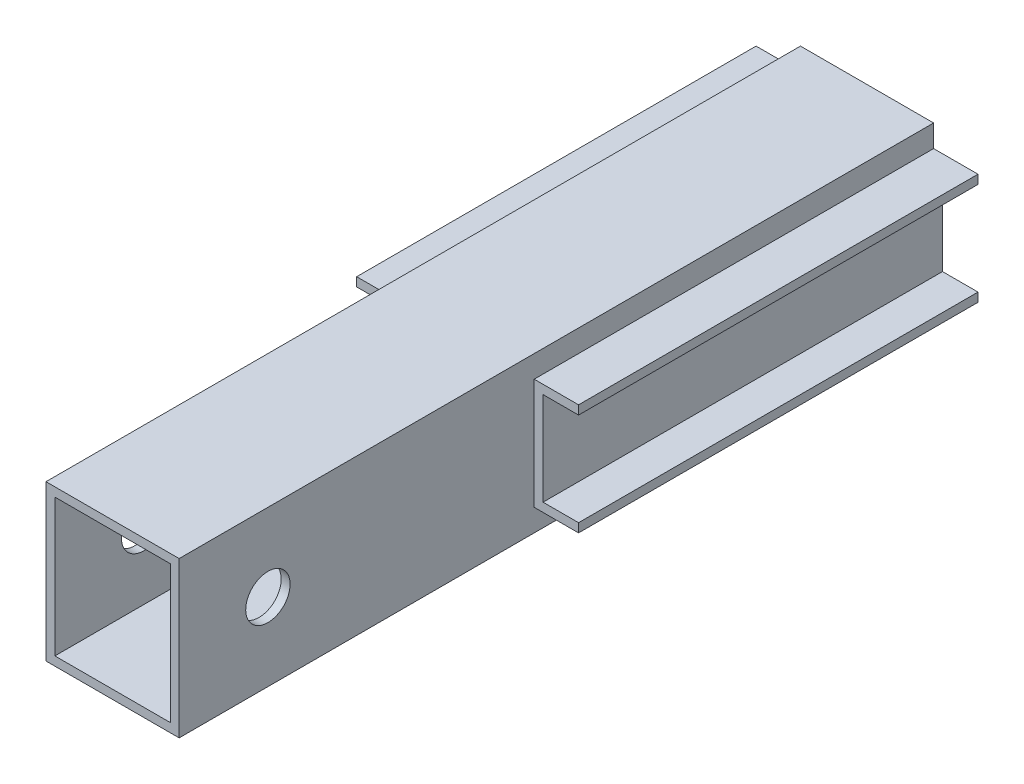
from build123d import *

# Parameters (mm, degrees)
ESQUISSE1_W             = 30
ESQUISSE1_H             = 35
ESQUISSE1_W_2           = 26
ESQUISSE1_H_2           = 31
BASE_EXTRUSION_DEPTH    = 530
BOSS_EXTRU_1_DEPTH      = 450
ESQUISSE3_W             = 120
ESQUISSE3_H             = 30
BOSS_EXTRU_2_DEPTH      = 10
ESQUISSE4_R             = 6
ENL_V_MAT_EXTRU_1_DEPTH = 603.334002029
ESQUISSE7_R             = 5
ENL_V_MAT_EXTRU_2_DEPTH = 602.586444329
ESQUISSE8_W             = 130
ESQUISSE8_H             = 1050
ENL_V_MAT_EXTRU_3_DEPTH = 602.539691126


with BuildPart() as part:
    # Esquisse1 → Base-Extrusion (new, symmetric)
    with BuildSketch(Plane.XY):
        Rectangle(ESQUISSE1_W, ESQUISSE1_H)
        Rectangle(ESQUISSE1_W_2, ESQUISSE1_H_2, mode=Mode.SUBTRACT)
    extrude(amount=BASE_EXTRUSION_DEPTH, both=True)

    # Esquisse2 → Boss.-Extru.1 (add, symmetric)
    with BuildSketch(Plane.XY):
        Polygon((15, 12.5), (15, -12.5), (25, -12.5), (25, -10.5), (17, -10.5), (17, 10.5), (25, 10.5), (25, 12.5), align=None)
    boss_extru_1 = extrude(amount=BOSS_EXTRU_1_DEPTH, both=True)

    # Esquisse3 → Boss.-Extru.2 (add)
    with BuildSketch(Plane(origin=(15, 0, 0), x_dir=(0, 0, -1), z_dir=(1, 0, 0))):
        with Locations((540, 0)):
            Rectangle(ESQUISSE3_W, ESQUISSE3_H)
    extrude(amount=BOSS_EXTRU_2_DEPTH)

    # Sym_trie1: Boss.-Extru.1 across plane
    add(boss_extru_1.mirror(Plane(origin=(0, 0, 0), x_dir=(0, 0, 1), z_dir=(1, 0, 0))))

    # Esquisse4 → Enl_v. mat.-Extru.1 (cut, through all)
    with BuildSketch(Plane(origin=(25, 0, 0), x_dir=(0, 0, -1), z_dir=(1, 0, 0))):
        with Locations((580, 0)):
            Circle(ESQUISSE4_R)
    extrude(amount=-ENL_V_MAT_EXTRU_1_DEPTH, mode=Mode.SUBTRACT)

    # Esquisse7 → Enl_v. mat.-Extru.2 (cut, through all)
    with BuildSketch(Plane(origin=(15, 0, 0), x_dir=(0, 0, -1), z_dir=(1, 0, 0))):
        with Locations(Location((-510, 0, 0), (0, 0, 90))):
            Circle(ESQUISSE7_R)
    extrude(amount=-ENL_V_MAT_EXTRU_2_DEPTH, mode=Mode.SUBTRACT)

    # Esquisse8 → Enl_v. mat.-Extru.3 (cut, through all)
    with BuildSketch(Plane(origin=(0, 17.5, 0), x_dir=(-1, 0, 0), z_dir=(0, 1, 0))):
        with Locations((13.856651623, -165)):
            Rectangle(ESQUISSE8_W, ESQUISSE8_H)
    extrude(amount=-ENL_V_MAT_EXTRU_3_DEPTH, mode=Mode.SUBTRACT)


solid = part.part
